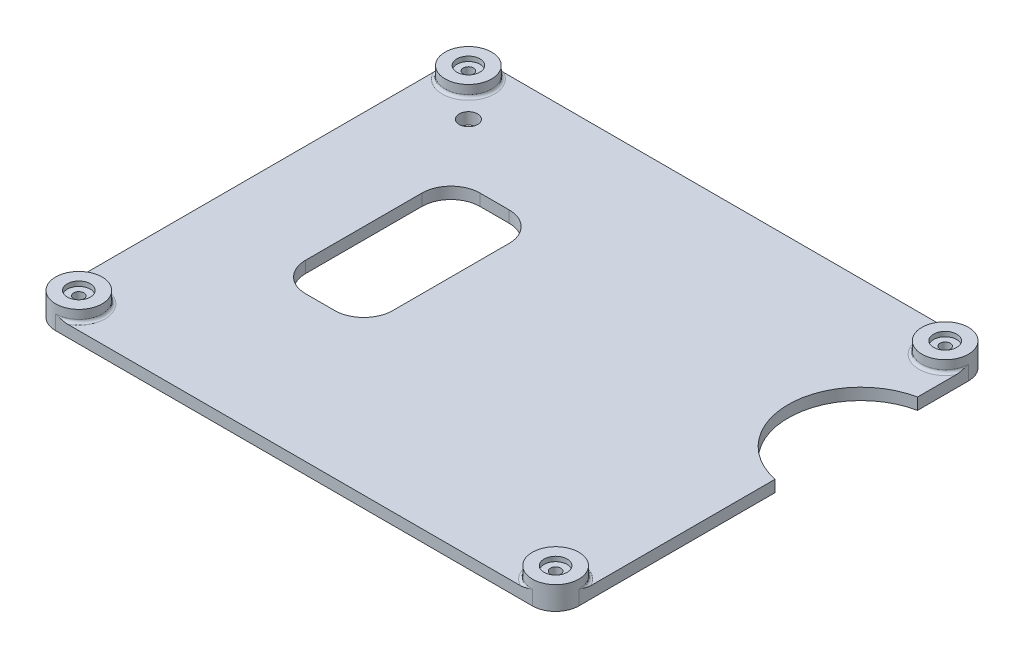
ISO-10303-21;
HEADER;
FILE_DESCRIPTION(('STEP AP214'),'2;1');
FILE_NAME('part.step','',(''),(''),'','','');
FILE_SCHEMA(('AUTOMOTIVE_DESIGN { 1 0 10303 214 1 1 1 1 }'));
ENDSEC;
DATA;
#1=APPLICATION_CONTEXT('core data for automotive mechanical design processes');
#2=APPLICATION_PROTOCOL_DEFINITION('international standard','automotive_design',2000,#1);
#3=PRODUCT_CONTEXT('',#1,'mechanical');
#4=PRODUCT('Part','Part','',(#3));
#5=PRODUCT_RELATED_PRODUCT_CATEGORY('part','',(#4));
#6=PRODUCT_DEFINITION_FORMATION('','',#4);
#7=PRODUCT_DEFINITION_CONTEXT('part definition',#1,'design');
#8=PRODUCT_DEFINITION('design','',#6,#7);
#9=PRODUCT_DEFINITION_SHAPE('','',#8);
#10=(LENGTH_UNIT() NAMED_UNIT(*) SI_UNIT(.MILLI.,.METRE.));
#11=(NAMED_UNIT(*) PLANE_ANGLE_UNIT() SI_UNIT($,.RADIAN.));
#12=(NAMED_UNIT(*) SI_UNIT($,.STERADIAN.) SOLID_ANGLE_UNIT());
#13=UNCERTAINTY_MEASURE_WITH_UNIT(LENGTH_MEASURE(1.E-05),#10,'distance_accuracy_value','');
#14=(GEOMETRIC_REPRESENTATION_CONTEXT(3) GLOBAL_UNCERTAINTY_ASSIGNED_CONTEXT((#13)) GLOBAL_UNIT_ASSIGNED_CONTEXT((#10,
#11,#12)) REPRESENTATION_CONTEXT('',''));
#15=CARTESIAN_POINT('',(0.,0.,0.));
#16=DIRECTION('',(0.,0.,1.));
#17=DIRECTION('',(1.,0.,0.));
#18=AXIS2_PLACEMENT_3D('',#15,#16,#17);
#19=CARTESIAN_POINT('',(-45.,2.,-37.5));
#20=DIRECTION('',(0.,-1.,0.));
#21=DIRECTION('',(0.,0.,-1.));
#22=AXIS2_PLACEMENT_3D('',#19,#20,#21);
#23=PLANE('',#22);
#24=CARTESIAN_POINT('',(-35.,2.,-27.5));
#25=DIRECTION('',(0.,1.,0.));
#26=DIRECTION('',(0.,0.,1.));
#27=AXIS2_PLACEMENT_3D('',#24,#25,#26);
#28=CIRCLE('',#27,1.5875);
#29=CARTESIAN_POINT('',(-35.,2.,-25.9125));
#30=VERTEX_POINT('',#29);
#31=EDGE_CURVE('E555',#30,#30,#28,.T.);
#32=ORIENTED_EDGE('',*,*,#31,.F.);
#33=EDGE_LOOP('',(#32));
#34=FACE_BOUND('',#33,.T.);
#35=DIRECTION('',(0.,0.,1.));
#36=VECTOR('',#35,1.);
#37=CARTESIAN_POINT('',(-28.,2.,-12.5));
#38=LINE('',#37,#36);
#39=CARTESIAN_POINT('',(-28.,2.,-12.5));
#40=VERTEX_POINT('',#39);
#41=CARTESIAN_POINT('',(-28.,2.,7.5));
#42=VERTEX_POINT('',#41);
#43=EDGE_CURVE('E196',#40,#42,#38,.T.);
#44=ORIENTED_EDGE('',*,*,#43,.F.);
#45=CARTESIAN_POINT('',(-23.,2.,-12.5));
#46=DIRECTION('',(0.,1.,0.));
#47=DIRECTION('',(0.,0.,1.));
#48=AXIS2_PLACEMENT_3D('',#45,#46,#47);
#49=CIRCLE('',#48,5.);
#50=CARTESIAN_POINT('',(-23.,2.,-17.5));
#51=VERTEX_POINT('',#50);
#52=EDGE_CURVE('E200',#51,#40,#49,.T.);
#53=ORIENTED_EDGE('',*,*,#52,.F.);
#54=DIRECTION('',(-1.,0.,0.));
#55=VECTOR('',#54,1.);
#56=CARTESIAN_POINT('',(-23.,2.,-17.5));
#57=LINE('',#56,#55);
#58=CARTESIAN_POINT('',(-18.,2.,-17.5));
#59=VERTEX_POINT('',#58);
#60=EDGE_CURVE('E219',#59,#51,#57,.T.);
#61=ORIENTED_EDGE('',*,*,#60,.F.);
#62=CARTESIAN_POINT('',(-18.,2.,-12.5));
#63=DIRECTION('',(0.,1.,0.));
#64=DIRECTION('',(0.,0.,-1.));
#65=AXIS2_PLACEMENT_3D('',#62,#63,#64);
#66=CIRCLE('',#65,5.);
#67=CARTESIAN_POINT('',(-13.,2.,-12.5));
#68=VERTEX_POINT('',#67);
#69=EDGE_CURVE('E216',#68,#59,#66,.T.);
#70=ORIENTED_EDGE('',*,*,#69,.F.);
#71=DIRECTION('',(0.,0.,-1.));
#72=VECTOR('',#71,1.);
#73=CARTESIAN_POINT('',(-13.,2.,-12.5));
#74=LINE('',#73,#72);
#75=CARTESIAN_POINT('',(-13.,2.,7.5));
#76=VERTEX_POINT('',#75);
#77=EDGE_CURVE('E213',#76,#68,#74,.T.);
#78=ORIENTED_EDGE('',*,*,#77,.F.);
#79=CARTESIAN_POINT('',(-18.,2.,7.5));
#80=DIRECTION('',(0.,1.,0.));
#81=DIRECTION('',(0.,0.,1.));
#82=AXIS2_PLACEMENT_3D('',#79,#80,#81);
#83=CIRCLE('',#82,5.);
#84=CARTESIAN_POINT('',(-18.,2.,12.5));
#85=VERTEX_POINT('',#84);
#86=EDGE_CURVE('E207',#85,#76,#83,.T.);
#87=ORIENTED_EDGE('',*,*,#86,.F.);
#88=DIRECTION('',(1.,0.,0.));
#89=VECTOR('',#88,1.);
#90=CARTESIAN_POINT('',(-23.,2.,12.5));
#91=LINE('',#90,#89);
#92=CARTESIAN_POINT('',(-23.,2.,12.5));
#93=VERTEX_POINT('',#92);
#94=EDGE_CURVE('E205',#93,#85,#91,.T.);
#95=ORIENTED_EDGE('',*,*,#94,.F.);
#96=CARTESIAN_POINT('',(-23.,2.,7.5));
#97=DIRECTION('',(0.,1.,0.));
#98=DIRECTION('',(0.,0.,1.));
#99=AXIS2_PLACEMENT_3D('',#96,#97,#98);
#100=CIRCLE('',#99,5.);
#101=EDGE_CURVE('E184',#42,#93,#100,.T.);
#102=ORIENTED_EDGE('',*,*,#101,.F.);
#103=EDGE_LOOP('',(#44,#53,#61,#70,#78,#87,#95,#102));
#104=FACE_BOUND('',#103,.T.);
#105=DIRECTION('',(1.,0.,0.));
#106=VECTOR('',#105,1.);
#107=CARTESIAN_POINT('',(-45.,2.,37.5));
#108=LINE('',#107,#106);
#109=CARTESIAN_POINT('',(-38.9384471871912,2.,37.5));
#110=VERTEX_POINT('',#109);
#111=CARTESIAN_POINT('',(38.9384471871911,2.,37.5));
#112=VERTEX_POINT('',#111);
#113=EDGE_CURVE('E317',#110,#112,#108,.T.);
#114=ORIENTED_EDGE('',*,*,#113,.T.);
#115=CARTESIAN_POINT('',(41.,2.,33.5));
#116=DIRECTION('',(0.,-1.,0.));
#117=DIRECTION('',(0.,0.,-1.));
#118=AXIS2_PLACEMENT_3D('',#115,#116,#117);
#119=CIRCLE('',#118,4.5);
#120=CARTESIAN_POINT('',(45.,2.,31.4384471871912));
#121=VERTEX_POINT('',#120);
#122=EDGE_CURVE('E329',#112,#121,#119,.T.);
#123=ORIENTED_EDGE('',*,*,#122,.T.);
#124=DIRECTION('',(0.,0.,-1.));
#125=VECTOR('',#124,1.);
#126=CARTESIAN_POINT('',(45.,2.,37.5));
#127=LINE('',#126,#125);
#128=CARTESIAN_POINT('',(45.,2.,-0.252551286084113));
#129=VERTEX_POINT('',#128);
#130=EDGE_CURVE('E276',#121,#129,#127,.T.);
#131=ORIENTED_EDGE('',*,*,#130,.T.);
#132=CARTESIAN_POINT('',(47.5,2.,-12.5));
#133=DIRECTION('',(0.,-1.,0.));
#134=DIRECTION('',(0.,0.,-1.));
#135=AXIS2_PLACEMENT_3D('',#132,#133,#134);
#136=CIRCLE('',#135,12.5);
#137=CARTESIAN_POINT('',(45.,2.,-24.7474487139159));
#138=VERTEX_POINT('',#137);
#139=EDGE_CURVE('E258',#138,#129,#136,.F.);
#140=ORIENTED_EDGE('',*,*,#139,.F.);
#141=CARTESIAN_POINT('',(45.,2.,-31.4384471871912));
#142=VERTEX_POINT('',#141);
#143=EDGE_CURVE('E279',#138,#142,#127,.T.);
#144=ORIENTED_EDGE('',*,*,#143,.T.);
#145=CARTESIAN_POINT('',(41.,2.,-33.5));
#146=DIRECTION('',(0.,-1.,0.));
#147=DIRECTION('',(0.,0.,-1.));
#148=AXIS2_PLACEMENT_3D('',#145,#146,#147);
#149=CIRCLE('',#148,4.5);
#150=CARTESIAN_POINT('',(38.9384471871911,2.,-37.5));
#151=VERTEX_POINT('',#150);
#152=EDGE_CURVE('E327',#142,#151,#149,.T.);
#153=ORIENTED_EDGE('',*,*,#152,.T.);
#154=DIRECTION('',(-1.,0.,0.));
#155=VECTOR('',#154,1.);
#156=CARTESIAN_POINT('',(-45.,2.,-37.5));
#157=LINE('',#156,#155);
#158=CARTESIAN_POINT('',(-38.9384471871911,2.,-37.5));
#159=VERTEX_POINT('',#158);
#160=EDGE_CURVE('E278',#151,#159,#157,.T.);
#161=ORIENTED_EDGE('',*,*,#160,.T.);
#162=CARTESIAN_POINT('',(-41.,2.,-33.5));
#163=DIRECTION('',(0.,-1.,0.));
#164=DIRECTION('',(0.,0.,-1.));
#165=AXIS2_PLACEMENT_3D('',#162,#163,#164);
#166=CIRCLE('',#165,4.5);
#167=CARTESIAN_POINT('',(-45.,2.,-31.4384471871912));
#168=VERTEX_POINT('',#167);
#169=EDGE_CURVE('E325',#159,#168,#166,.T.);
#170=ORIENTED_EDGE('',*,*,#169,.T.);
#171=DIRECTION('',(0.,0.,1.));
#172=VECTOR('',#171,1.);
#173=CARTESIAN_POINT('',(-45.,2.,37.5));
#174=LINE('',#173,#172);
#175=CARTESIAN_POINT('',(-45.,2.,31.4384471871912));
#176=VERTEX_POINT('',#175);
#177=EDGE_CURVE('E275',#168,#176,#174,.T.);
#178=ORIENTED_EDGE('',*,*,#177,.T.);
#179=CARTESIAN_POINT('',(-41.,2.,33.5));
#180=DIRECTION('',(0.,-1.,0.));
#181=DIRECTION('',(0.,0.,-1.));
#182=AXIS2_PLACEMENT_3D('',#179,#180,#181);
#183=CIRCLE('',#182,4.5);
#184=EDGE_CURVE('E323',#176,#110,#183,.T.);
#185=ORIENTED_EDGE('',*,*,#184,.T.);
#186=EDGE_LOOP('',(#114,#123,#131,#140,#144,#153,#161,#170,#178,#185));
#187=FACE_BOUND('',#186,.T.);
#188=ADVANCED_FACE('F28',(#34,#104,#187),#23,.F.);
#189=CARTESIAN_POINT('',(45.,2.,37.5));
#190=DIRECTION('',(-1.,0.,0.));
#191=DIRECTION('',(0.,0.,1.));
#192=AXIS2_PLACEMENT_3D('',#189,#190,#191);
#193=PLANE('',#192);
#194=DIRECTION('',(0.,-1.,0.));
#195=VECTOR('',#194,1.);
#196=CARTESIAN_POINT('',(45.,148.463519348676,-24.7474487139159));
#197=LINE('',#196,#195);
#198=CARTESIAN_POINT('',(45.,0.,-24.7474487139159));
#199=VERTEX_POINT('',#198);
#200=EDGE_CURVE('E245',#138,#199,#197,.T.);
#201=ORIENTED_EDGE('',*,*,#200,.T.);
#202=DIRECTION('',(0.,0.,-1.));
#203=VECTOR('',#202,1.);
#204=CARTESIAN_POINT('',(45.,0.,37.5));
#205=LINE('',#204,#203);
#206=CARTESIAN_POINT('',(45.,0.,-33.5));
#207=VERTEX_POINT('',#206);
#208=EDGE_CURVE('E268',#199,#207,#205,.T.);
#209=ORIENTED_EDGE('',*,*,#208,.T.);
#210=DIRECTION('',(0.,-1.,0.));
#211=VECTOR('',#210,1.);
#212=CARTESIAN_POINT('',(45.,2.,-33.5));
#213=LINE('',#212,#211);
#214=CARTESIAN_POINT('',(45.,2.5,-33.5));
#215=VERTEX_POINT('',#214);
#216=EDGE_CURVE('E282',#207,#215,#213,.F.);
#217=ORIENTED_EDGE('',*,*,#216,.T.);
#218=CARTESIAN_POINT('',(45.,2.,-31.4384471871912));
#219=CARTESIAN_POINT('',(45.,2.000008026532,-31.4809892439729));
#220=CARTESIAN_POINT('',(45.,2.00113841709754,-31.5235145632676));
#221=CARTESIAN_POINT('',(45.,2.00537603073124,-31.6084445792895));
#222=CARTESIAN_POINT('',(45.,2.00848213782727,-31.6508493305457));
#223=CARTESIAN_POINT('',(45.,2.02034471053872,-31.7776096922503));
#224=CARTESIAN_POINT('',(45.,2.0316481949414,-31.8617275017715));
#225=CARTESIAN_POINT('',(45.,2.05935852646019,-32.0284274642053));
#226=CARTESIAN_POINT('',(45.,2.07572639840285,-32.1110164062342));
#227=CARTESIAN_POINT('',(45.,2.11243465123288,-32.2753554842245));
#228=CARTESIAN_POINT('',(45.,2.13277785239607,-32.3571049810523));
#229=CARTESIAN_POINT('',(45.,2.20227499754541,-32.6160090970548));
#230=CARTESIAN_POINT('',(45.,2.25704389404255,-32.7916302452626));
#231=CARTESIAN_POINT('',(45.,2.37310658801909,-33.140867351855));
#232=CARTESIAN_POINT('',(45.,2.43441045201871,-33.3144797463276));
#233=CARTESIAN_POINT('',(45.,2.49718908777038,-33.492049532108));
#234=CARTESIAN_POINT('',(45.,2.49859454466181,-33.4960247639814));
#235=CARTESIAN_POINT('',(45.,2.5,-33.5));
#236=B_SPLINE_CURVE_WITH_KNOTS('',3,(#218,#219,#220,#221,#222,#223,#224,#225,#226,#227,#228,
#229,#230,#231,#232,#233,#234,#235),.UNSPECIFIED.,.F.,.F.,(4,2,2,2,2,2,2,2,4),(0.,
0.127585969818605,0.255099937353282,0.509481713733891,0.761952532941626,1.01460312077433,
1.56611411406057,2.11848728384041,2.13113639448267),.UNSPECIFIED.);
#237=EDGE_CURVE('E407',#215,#142,#236,.F.);
#238=ORIENTED_EDGE('',*,*,#237,.T.);
#239=ORIENTED_EDGE('',*,*,#143,.F.);
#240=EDGE_LOOP('',(#201,#209,#217,#238,#239));
#241=FACE_BOUND('',#240,.T.);
#242=ADVANCED_FACE('F360',(#241),#193,.F.);
#243=DIRECTION('',(0.,-1.,0.));
#244=VECTOR('',#243,1.);
#245=CARTESIAN_POINT('',(45.,148.463519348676,-0.252551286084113));
#246=LINE('',#245,#244);
#247=CARTESIAN_POINT('',(45.,0.,-0.252551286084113));
#248=VERTEX_POINT('',#247);
#249=EDGE_CURVE('E256',#129,#248,#246,.T.);
#250=ORIENTED_EDGE('',*,*,#249,.F.);
#251=ORIENTED_EDGE('',*,*,#130,.F.);
#252=CARTESIAN_POINT('',(45.,2.,31.4384471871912));
#253=CARTESIAN_POINT('',(45.,2.00000802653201,31.4809892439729));
#254=CARTESIAN_POINT('',(45.,2.00113841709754,31.5235145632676));
#255=CARTESIAN_POINT('',(45.,2.00537603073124,31.6084445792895));
#256=CARTESIAN_POINT('',(45.,2.00848213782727,31.6508493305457));
#257=CARTESIAN_POINT('',(45.,2.02034471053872,31.7776096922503));
#258=CARTESIAN_POINT('',(45.,2.0316481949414,31.8617275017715));
#259=CARTESIAN_POINT('',(45.,2.05935852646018,32.0284274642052));
#260=CARTESIAN_POINT('',(45.,2.07572639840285,32.1110164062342));
#261=CARTESIAN_POINT('',(45.,2.11243465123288,32.2753554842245));
#262=CARTESIAN_POINT('',(45.,2.13277785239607,32.3571049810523));
#263=CARTESIAN_POINT('',(45.,2.20227499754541,32.6160090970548));
#264=CARTESIAN_POINT('',(45.,2.25704389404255,32.7916302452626));
#265=CARTESIAN_POINT('',(45.,2.37310658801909,33.140867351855));
#266=CARTESIAN_POINT('',(45.,2.43441045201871,33.3144797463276));
#267=CARTESIAN_POINT('',(45.,2.49718908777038,33.492049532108));
#268=CARTESIAN_POINT('',(45.,2.49859454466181,33.4960247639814));
#269=CARTESIAN_POINT('',(45.,2.5,33.5));
#270=B_SPLINE_CURVE_WITH_KNOTS('',3,(#252,#253,#254,#255,#256,#257,#258,#259,#260,#261,#262,
#263,#264,#265,#266,#267,#268,#269),.UNSPECIFIED.,.F.,.F.,(4,2,2,2,2,2,2,2,4),(0.,
0.127585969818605,0.255099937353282,0.50948171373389,0.761952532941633,1.01460312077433,
1.56611411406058,2.11848728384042,2.13113639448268),.UNSPECIFIED.);
#271=CARTESIAN_POINT('',(45.,2.5,33.5));
#272=VERTEX_POINT('',#271);
#273=EDGE_CURVE('E345',#121,#272,#270,.T.);
#274=ORIENTED_EDGE('',*,*,#273,.T.);
#275=DIRECTION('',(0.,-1.,0.));
#276=VECTOR('',#275,1.);
#277=CARTESIAN_POINT('',(45.,2.,33.5));
#278=LINE('',#277,#276);
#279=CARTESIAN_POINT('',(45.,0.,33.5));
#280=VERTEX_POINT('',#279);
#281=EDGE_CURVE('E284',#272,#280,#278,.T.);
#282=ORIENTED_EDGE('',*,*,#281,.T.);
#283=EDGE_CURVE('E269',#280,#248,#205,.T.);
#284=ORIENTED_EDGE('',*,*,#283,.T.);
#285=EDGE_LOOP('',(#250,#251,#274,#282,#284));
#286=FACE_BOUND('',#285,.T.);
#287=ADVANCED_FACE('F427',(#286),#193,.F.);
#288=CARTESIAN_POINT('',(-45.,0.,-37.5));
#289=DIRECTION('',(0.,-1.,0.));
#290=DIRECTION('',(0.,0.,-1.));
#291=AXIS2_PLACEMENT_3D('',#288,#289,#290);
#292=PLANE('',#291);
#293=CARTESIAN_POINT('',(-35.,0.,-27.5));
#294=DIRECTION('',(0.,-1.,0.));
#295=DIRECTION('',(0.,0.,-1.));
#296=AXIS2_PLACEMENT_3D('',#293,#294,#295);
#297=CIRCLE('',#296,1.5875);
#298=CARTESIAN_POINT('',(-35.,0.,-29.0875));
#299=VERTEX_POINT('',#298);
#300=EDGE_CURVE('E33',#299,#299,#297,.T.);
#301=ORIENTED_EDGE('',*,*,#300,.F.);
#302=EDGE_LOOP('',(#301));
#303=FACE_BOUND('',#302,.T.);
#304=CARTESIAN_POINT('',(-41.,0.,-33.5));
#305=DIRECTION('',(0.,-1.,0.));
#306=DIRECTION('',(0.,0.,-1.));
#307=AXIS2_PLACEMENT_3D('',#304,#305,#306);
#308=CIRCLE('',#307,0.889000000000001);
#309=CARTESIAN_POINT('',(-41.,0.,-34.389));
#310=VERTEX_POINT('',#309);
#311=EDGE_CURVE('E545',#310,#310,#308,.T.);
#312=ORIENTED_EDGE('',*,*,#311,.F.);
#313=EDGE_LOOP('',(#312));
#314=FACE_BOUND('',#313,.T.);
#315=CARTESIAN_POINT('',(-41.,0.,33.5));
#316=DIRECTION('',(0.,-1.,0.));
#317=DIRECTION('',(0.,0.,-1.));
#318=AXIS2_PLACEMENT_3D('',#315,#316,#317);
#319=CIRCLE('',#318,0.889000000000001);
#320=CARTESIAN_POINT('',(-41.,0.,32.611));
#321=VERTEX_POINT('',#320);
#322=EDGE_CURVE('E569',#321,#321,#319,.T.);
#323=ORIENTED_EDGE('',*,*,#322,.F.);
#324=EDGE_LOOP('',(#323));
#325=FACE_BOUND('',#324,.T.);
#326=CARTESIAN_POINT('',(41.,0.,33.5));
#327=DIRECTION('',(0.,-1.,0.));
#328=DIRECTION('',(0.,0.,-1.));
#329=AXIS2_PLACEMENT_3D('',#326,#327,#328);
#330=CIRCLE('',#329,0.889000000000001);
#331=CARTESIAN_POINT('',(41.,0.,32.611));
#332=VERTEX_POINT('',#331);
#333=EDGE_CURVE('E579',#332,#332,#330,.T.);
#334=ORIENTED_EDGE('',*,*,#333,.F.);
#335=EDGE_LOOP('',(#334));
#336=FACE_BOUND('',#335,.T.);
#337=CARTESIAN_POINT('',(41.,0.,-33.5));
#338=DIRECTION('',(0.,-1.,0.));
#339=DIRECTION('',(0.,0.,-1.));
#340=AXIS2_PLACEMENT_3D('',#337,#338,#339);
#341=CIRCLE('',#340,0.889000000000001);
#342=CARTESIAN_POINT('',(41.,0.,-34.389));
#343=VERTEX_POINT('',#342);
#344=EDGE_CURVE('E589',#343,#343,#341,.T.);
#345=ORIENTED_EDGE('',*,*,#344,.F.);
#346=EDGE_LOOP('',(#345));
#347=FACE_BOUND('',#346,.T.);
#348=CARTESIAN_POINT('',(-23.,0.,-12.5));
#349=DIRECTION('',(0.,1.,0.));
#350=DIRECTION('',(0.,0.,1.));
#351=AXIS2_PLACEMENT_3D('',#348,#349,#350);
#352=CIRCLE('',#351,5.);
#353=CARTESIAN_POINT('',(-23.,0.,-17.5));
#354=VERTEX_POINT('',#353);
#355=CARTESIAN_POINT('',(-28.,0.,-12.5));
#356=VERTEX_POINT('',#355);
#357=EDGE_CURVE('E222',#354,#356,#352,.T.);
#358=ORIENTED_EDGE('',*,*,#357,.T.);
#359=DIRECTION('',(0.,0.,1.));
#360=VECTOR('',#359,1.);
#361=CARTESIAN_POINT('',(-28.,0.,-12.5));
#362=LINE('',#361,#360);
#363=CARTESIAN_POINT('',(-28.,0.,7.5));
#364=VERTEX_POINT('',#363);
#365=EDGE_CURVE('E225',#356,#364,#362,.T.);
#366=ORIENTED_EDGE('',*,*,#365,.T.);
#367=CARTESIAN_POINT('',(-23.,0.,7.5));
#368=DIRECTION('',(0.,1.,0.));
#369=DIRECTION('',(0.,0.,1.));
#370=AXIS2_PLACEMENT_3D('',#367,#368,#369);
#371=CIRCLE('',#370,5.);
#372=CARTESIAN_POINT('',(-23.,0.,12.5));
#373=VERTEX_POINT('',#372);
#374=EDGE_CURVE('E187',#364,#373,#371,.T.);
#375=ORIENTED_EDGE('',*,*,#374,.T.);
#376=DIRECTION('',(1.,0.,0.));
#377=VECTOR('',#376,1.);
#378=CARTESIAN_POINT('',(-23.,0.,12.5));
#379=LINE('',#378,#377);
#380=CARTESIAN_POINT('',(-18.,0.,12.5));
#381=VERTEX_POINT('',#380);
#382=EDGE_CURVE('E228',#373,#381,#379,.T.);
#383=ORIENTED_EDGE('',*,*,#382,.T.);
#384=CARTESIAN_POINT('',(-18.,0.,7.5));
#385=DIRECTION('',(0.,1.,0.));
#386=DIRECTION('',(0.,0.,1.));
#387=AXIS2_PLACEMENT_3D('',#384,#385,#386);
#388=CIRCLE('',#387,5.);
#389=CARTESIAN_POINT('',(-13.,0.,7.5));
#390=VERTEX_POINT('',#389);
#391=EDGE_CURVE('E231',#381,#390,#388,.T.);
#392=ORIENTED_EDGE('',*,*,#391,.T.);
#393=DIRECTION('',(0.,0.,-1.));
#394=VECTOR('',#393,1.);
#395=CARTESIAN_POINT('',(-13.,0.,-12.5));
#396=LINE('',#395,#394);
#397=CARTESIAN_POINT('',(-13.,0.,-12.5));
#398=VERTEX_POINT('',#397);
#399=EDGE_CURVE('E234',#390,#398,#396,.T.);
#400=ORIENTED_EDGE('',*,*,#399,.T.);
#401=CARTESIAN_POINT('',(-18.,0.,-12.5));
#402=DIRECTION('',(0.,1.,0.));
#403=DIRECTION('',(0.,0.,-1.));
#404=AXIS2_PLACEMENT_3D('',#401,#402,#403);
#405=CIRCLE('',#404,5.);
#406=CARTESIAN_POINT('',(-18.,0.,-17.5));
#407=VERTEX_POINT('',#406);
#408=EDGE_CURVE('E237',#398,#407,#405,.T.);
#409=ORIENTED_EDGE('',*,*,#408,.T.);
#410=DIRECTION('',(-1.,0.,0.));
#411=VECTOR('',#410,1.);
#412=CARTESIAN_POINT('',(-23.,0.,-17.5));
#413=LINE('',#412,#411);
#414=EDGE_CURVE('E240',#407,#354,#413,.T.);
#415=ORIENTED_EDGE('',*,*,#414,.T.);
#416=EDGE_LOOP('',(#358,#366,#375,#383,#392,#400,#409,#415));
#417=FACE_BOUND('',#416,.T.);
#418=ORIENTED_EDGE('',*,*,#208,.F.);
#419=CARTESIAN_POINT('',(47.5,0.,-12.5));
#420=DIRECTION('',(0.,-1.,0.));
#421=DIRECTION('',(0.,0.,-1.));
#422=AXIS2_PLACEMENT_3D('',#419,#420,#421);
#423=CIRCLE('',#422,12.5);
#424=EDGE_CURVE('E306',#199,#248,#423,.F.);
#425=ORIENTED_EDGE('',*,*,#424,.T.);
#426=ORIENTED_EDGE('',*,*,#283,.F.);
#427=CARTESIAN_POINT('',(41.,0.,33.5));
#428=DIRECTION('',(0.,-1.,0.));
#429=DIRECTION('',(0.,0.,-1.));
#430=AXIS2_PLACEMENT_3D('',#427,#428,#429);
#431=CIRCLE('',#430,4.);
#432=CARTESIAN_POINT('',(41.,0.,37.5));
#433=VERTEX_POINT('',#432);
#434=EDGE_CURVE('E294',#280,#433,#431,.T.);
#435=ORIENTED_EDGE('',*,*,#434,.T.);
#436=DIRECTION('',(1.,0.,0.));
#437=VECTOR('',#436,1.);
#438=CARTESIAN_POINT('',(-45.,0.,37.5));
#439=LINE('',#438,#437);
#440=CARTESIAN_POINT('',(-41.,0.,37.5));
#441=VERTEX_POINT('',#440);
#442=EDGE_CURVE('E265',#441,#433,#439,.T.);
#443=ORIENTED_EDGE('',*,*,#442,.F.);
#444=CARTESIAN_POINT('',(-41.,0.,33.5));
#445=DIRECTION('',(0.,-1.,0.));
#446=DIRECTION('',(0.,0.,-1.));
#447=AXIS2_PLACEMENT_3D('',#444,#445,#446);
#448=CIRCLE('',#447,4.);
#449=CARTESIAN_POINT('',(-45.,0.,33.5));
#450=VERTEX_POINT('',#449);
#451=EDGE_CURVE('E287',#441,#450,#448,.T.);
#452=ORIENTED_EDGE('',*,*,#451,.T.);
#453=DIRECTION('',(0.,0.,1.));
#454=VECTOR('',#453,1.);
#455=CARTESIAN_POINT('',(-45.,0.,37.5));
#456=LINE('',#455,#454);
#457=CARTESIAN_POINT('',(-45.,0.,-33.5));
#458=VERTEX_POINT('',#457);
#459=EDGE_CURVE('E263',#458,#450,#456,.T.);
#460=ORIENTED_EDGE('',*,*,#459,.F.);
#461=CARTESIAN_POINT('',(-41.,0.,-33.5));
#462=DIRECTION('',(0.,-1.,0.));
#463=DIRECTION('',(0.,0.,-1.));
#464=AXIS2_PLACEMENT_3D('',#461,#462,#463);
#465=CIRCLE('',#464,4.);
#466=CARTESIAN_POINT('',(-41.,0.,-37.5));
#467=VERTEX_POINT('',#466);
#468=EDGE_CURVE('E289',#458,#467,#465,.T.);
#469=ORIENTED_EDGE('',*,*,#468,.T.);
#470=DIRECTION('',(-1.,0.,0.));
#471=VECTOR('',#470,1.);
#472=CARTESIAN_POINT('',(-45.,0.,-37.5));
#473=LINE('',#472,#471);
#474=CARTESIAN_POINT('',(41.,0.,-37.5));
#475=VERTEX_POINT('',#474);
#476=EDGE_CURVE('E272',#475,#467,#473,.T.);
#477=ORIENTED_EDGE('',*,*,#476,.F.);
#478=CARTESIAN_POINT('',(41.,0.,-33.5));
#479=DIRECTION('',(0.,-1.,0.));
#480=DIRECTION('',(0.,0.,-1.));
#481=AXIS2_PLACEMENT_3D('',#478,#479,#480);
#482=CIRCLE('',#481,4.);
#483=EDGE_CURVE('E291',#475,#207,#482,.T.);
#484=ORIENTED_EDGE('',*,*,#483,.T.);
#485=EDGE_LOOP('',(#418,#425,#426,#435,#443,#452,#460,#469,#477,#484));
#486=FACE_BOUND('',#485,.T.);
#487=ADVANCED_FACE('F424',(#303,#314,#325,#336,#347,#417,#486),#292,.T.);
#488=CARTESIAN_POINT('',(-45.,2.,37.5));
#489=DIRECTION('',(1.,0.,0.));
#490=DIRECTION('',(0.,0.,-1.));
#491=AXIS2_PLACEMENT_3D('',#488,#489,#490);
#492=PLANE('',#491);
#493=ORIENTED_EDGE('',*,*,#177,.F.);
#494=CARTESIAN_POINT('',(-45.,2.,-31.4384471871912));
#495=CARTESIAN_POINT('',(-45.,2.000008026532,-31.4809892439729));
#496=CARTESIAN_POINT('',(-45.,2.00113841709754,-31.5235145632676));
#497=CARTESIAN_POINT('',(-45.,2.00537603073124,-31.6084445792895));
#498=CARTESIAN_POINT('',(-45.,2.00848213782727,-31.6508493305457));
#499=CARTESIAN_POINT('',(-45.,2.02034471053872,-31.7776096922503));
#500=CARTESIAN_POINT('',(-45.,2.0316481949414,-31.8617275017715));
#501=CARTESIAN_POINT('',(-45.,2.05935852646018,-32.0284274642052));
#502=CARTESIAN_POINT('',(-45.,2.07572639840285,-32.1110164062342));
#503=CARTESIAN_POINT('',(-45.,2.11243465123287,-32.2753554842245));
#504=CARTESIAN_POINT('',(-45.,2.13277785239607,-32.3571049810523));
#505=CARTESIAN_POINT('',(-45.,2.20227499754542,-32.6160090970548));
#506=CARTESIAN_POINT('',(-45.,2.25704389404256,-32.7916302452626));
#507=CARTESIAN_POINT('',(-45.,2.37310658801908,-33.140867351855));
#508=CARTESIAN_POINT('',(-45.,2.43441045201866,-33.3144797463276));
#509=CARTESIAN_POINT('',(-45.,2.49718908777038,-33.4920495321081));
#510=CARTESIAN_POINT('',(-45.,2.49859454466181,-33.4960247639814));
#511=CARTESIAN_POINT('',(-45.,2.5,-33.5));
#512=B_SPLINE_CURVE_WITH_KNOTS('',3,(#494,#495,#496,#497,#498,#499,#500,#501,#502,#503,#504,
#505,#506,#507,#508,#509,#510,#511),.UNSPECIFIED.,.F.,.F.,(4,2,2,2,2,2,2,2,4),(0.,
0.127585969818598,0.255099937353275,0.509481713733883,0.761952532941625,1.01460312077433,
1.56611411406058,2.11848728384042,2.13113639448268),.UNSPECIFIED.);
#513=CARTESIAN_POINT('',(-45.,2.5,-33.5));
#514=VERTEX_POINT('',#513);
#515=EDGE_CURVE('E394',#168,#514,#512,.T.);
#516=ORIENTED_EDGE('',*,*,#515,.T.);
#517=DIRECTION('',(0.,-1.,0.));
#518=VECTOR('',#517,1.);
#519=CARTESIAN_POINT('',(-45.,2.,-33.5));
#520=LINE('',#519,#518);
#521=EDGE_CURVE('E303',#514,#458,#520,.T.);
#522=ORIENTED_EDGE('',*,*,#521,.T.);
#523=ORIENTED_EDGE('',*,*,#459,.T.);
#524=DIRECTION('',(0.,-1.,0.));
#525=VECTOR('',#524,1.);
#526=CARTESIAN_POINT('',(-45.,2.,33.5));
#527=LINE('',#526,#525);
#528=CARTESIAN_POINT('',(-45.,2.5,33.5));
#529=VERTEX_POINT('',#528);
#530=EDGE_CURVE('E45',#450,#529,#527,.F.);
#531=ORIENTED_EDGE('',*,*,#530,.T.);
#532=CARTESIAN_POINT('',(-45.,2.,31.4384471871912));
#533=CARTESIAN_POINT('',(-45.,2.00000802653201,31.4809892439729));
#534=CARTESIAN_POINT('',(-45.,2.00113841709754,31.5235145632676));
#535=CARTESIAN_POINT('',(-45.,2.00537603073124,31.6084445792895));
#536=CARTESIAN_POINT('',(-45.,2.00848213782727,31.6508493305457));
#537=CARTESIAN_POINT('',(-45.,2.02034471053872,31.7776096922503));
#538=CARTESIAN_POINT('',(-45.,2.0316481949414,31.8617275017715));
#539=CARTESIAN_POINT('',(-45.,2.05935852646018,32.0284274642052));
#540=CARTESIAN_POINT('',(-45.,2.07572639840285,32.1110164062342));
#541=CARTESIAN_POINT('',(-45.,2.11243465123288,32.2753554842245));
#542=CARTESIAN_POINT('',(-45.,2.13277785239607,32.3571049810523));
#543=CARTESIAN_POINT('',(-45.,2.20227499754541,32.6160090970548));
#544=CARTESIAN_POINT('',(-45.,2.25704389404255,32.7916302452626));
#545=CARTESIAN_POINT('',(-45.,2.37310658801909,33.140867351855));
#546=CARTESIAN_POINT('',(-45.,2.43441045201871,33.3144797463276));
#547=CARTESIAN_POINT('',(-45.,2.49718908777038,33.492049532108));
#548=CARTESIAN_POINT('',(-45.,2.49859454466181,33.4960247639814));
#549=CARTESIAN_POINT('',(-45.,2.5,33.5));
#550=B_SPLINE_CURVE_WITH_KNOTS('',3,(#532,#533,#534,#535,#536,#537,#538,#539,#540,#541,#542,
#543,#544,#545,#546,#547,#548,#549),.UNSPECIFIED.,.F.,.F.,(4,2,2,2,2,2,2,2,4),(0.,
0.127585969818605,0.255099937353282,0.50948171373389,0.761952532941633,1.01460312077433,
1.56611411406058,2.11848728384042,2.13113639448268),.UNSPECIFIED.);
#551=EDGE_CURVE('E38',#529,#176,#550,.F.);
#552=ORIENTED_EDGE('',*,*,#551,.T.);
#553=EDGE_LOOP('',(#493,#516,#522,#523,#531,#552));
#554=FACE_BOUND('',#553,.T.);
#555=ADVANCED_FACE('F30',(#554),#492,.F.);
#556=CARTESIAN_POINT('',(-45.,2.,37.5));
#557=DIRECTION('',(0.,0.,-1.));
#558=DIRECTION('',(-1.,0.,0.));
#559=AXIS2_PLACEMENT_3D('',#556,#557,#558);
#560=PLANE('',#559);
#561=ORIENTED_EDGE('',*,*,#442,.T.);
#562=DIRECTION('',(0.,-1.,0.));
#563=VECTOR('',#562,1.);
#564=CARTESIAN_POINT('',(41.,2.,37.5));
#565=LINE('',#564,#563);
#566=CARTESIAN_POINT('',(41.,2.5,37.5));
#567=VERTEX_POINT('',#566);
#568=EDGE_CURVE('E296',#433,#567,#565,.F.);
#569=ORIENTED_EDGE('',*,*,#568,.T.);
#570=CARTESIAN_POINT('',(38.9384471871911,2.,37.5));
#571=CARTESIAN_POINT('',(38.980989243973,2.00000802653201,37.5));
#572=CARTESIAN_POINT('',(39.0235145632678,2.00113841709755,37.5));
#573=CARTESIAN_POINT('',(39.1084445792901,2.00537603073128,37.5));
#574=CARTESIAN_POINT('',(39.1508493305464,2.00848213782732,37.5));
#575=CARTESIAN_POINT('',(39.2776096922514,2.02034471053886,37.5));
#576=CARTESIAN_POINT('',(39.3617275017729,2.03164819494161,37.5));
#577=CARTESIAN_POINT('',(39.5284274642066,2.05935852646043,37.5));
#578=CARTESIAN_POINT('',(39.6110164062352,2.07572639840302,37.5));
#579=CARTESIAN_POINT('',(39.7753554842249,2.11243465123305,37.5));
#580=CARTESIAN_POINT('',(39.8571049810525,2.13277785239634,37.5));
#581=CARTESIAN_POINT('',(40.1160090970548,2.20227499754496,37.5));
#582=CARTESIAN_POINT('',(40.2916302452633,2.25704389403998,37.5));
#583=CARTESIAN_POINT('',(40.6408673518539,2.37310658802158,37.5));
#584=CARTESIAN_POINT('',(40.8144797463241,2.4344104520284,37.5));
#585=CARTESIAN_POINT('',(40.9920495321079,2.49718908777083,37.5));
#586=CARTESIAN_POINT('',(40.9960247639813,2.49859454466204,37.5));
#587=CARTESIAN_POINT('',(41.,2.5,37.5));
#588=B_SPLINE_CURVE_WITH_KNOTS('',3,(#570,#571,#572,#573,#574,#575,#576,#577,#578,#579,#580,
#581,#582,#583,#584,#585,#586,#587),.UNSPECIFIED.,.F.,.F.,(4,2,2,2,2,2,2,2,4),(0.,
0.127585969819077,0.255099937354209,0.50948171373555,0.761952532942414,1.01460312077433,
1.56611411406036,2.11848728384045,2.1311363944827),.UNSPECIFIED.);
#589=EDGE_CURVE('E339',#567,#112,#588,.F.);
#590=ORIENTED_EDGE('',*,*,#589,.T.);
#591=ORIENTED_EDGE('',*,*,#113,.F.);
#592=CARTESIAN_POINT('',(-38.9384471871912,2.,37.5));
#593=CARTESIAN_POINT('',(-38.980989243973,2.00000802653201,37.5));
#594=CARTESIAN_POINT('',(-39.0235145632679,2.00113841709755,37.5));
#595=CARTESIAN_POINT('',(-39.1084445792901,2.00537603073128,37.5));
#596=CARTESIAN_POINT('',(-39.1508493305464,2.00848213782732,37.5));
#597=CARTESIAN_POINT('',(-39.2776096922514,2.02034471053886,37.5));
#598=CARTESIAN_POINT('',(-39.3617275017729,2.03164819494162,37.5));
#599=CARTESIAN_POINT('',(-39.5284274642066,2.05935852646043,37.5));
#600=CARTESIAN_POINT('',(-39.6110164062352,2.07572639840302,37.5));
#601=CARTESIAN_POINT('',(-39.7753554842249,2.11243465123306,37.5));
#602=CARTESIAN_POINT('',(-39.8571049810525,2.13277785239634,37.5));
#603=CARTESIAN_POINT('',(-40.1160090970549,2.20227499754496,37.5));
#604=CARTESIAN_POINT('',(-40.2916302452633,2.25704389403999,37.5));
#605=CARTESIAN_POINT('',(-40.6408673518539,2.37310658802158,37.5));
#606=CARTESIAN_POINT('',(-40.8144797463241,2.43441045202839,37.5));
#607=CARTESIAN_POINT('',(-40.9920495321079,2.49718908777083,37.5));
#608=CARTESIAN_POINT('',(-40.9960247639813,2.49859454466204,37.5));
#609=CARTESIAN_POINT('',(-41.,2.5,37.5));
#610=B_SPLINE_CURVE_WITH_KNOTS('',3,(#592,#593,#594,#595,#596,#597,#598,#599,#600,#601,#602,
#603,#604,#605,#606,#607,#608,#609),.UNSPECIFIED.,.F.,.F.,(4,2,2,2,2,2,2,2,4),(0.,
0.127585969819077,0.255099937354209,0.50948171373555,0.761952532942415,1.01460312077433,
1.56611411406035,2.11848728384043,2.13113639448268),.UNSPECIFIED.);
#611=CARTESIAN_POINT('',(-41.,2.5,37.5));
#612=VERTEX_POINT('',#611);
#613=EDGE_CURVE('E11',#110,#612,#610,.T.);
#614=ORIENTED_EDGE('',*,*,#613,.T.);
#615=DIRECTION('',(0.,-1.,0.));
#616=VECTOR('',#615,1.);
#617=CARTESIAN_POINT('',(-41.,2.,37.5));
#618=LINE('',#617,#616);
#619=EDGE_CURVE('E53',#612,#441,#618,.T.);
#620=ORIENTED_EDGE('',*,*,#619,.T.);
#621=EDGE_LOOP('',(#561,#569,#590,#591,#614,#620));
#622=FACE_BOUND('',#621,.T.);
#623=ADVANCED_FACE('F355',(#622),#560,.F.);
#624=CARTESIAN_POINT('',(-45.,2.,-37.5));
#625=DIRECTION('',(0.,0.,1.));
#626=DIRECTION('',(1.,0.,0.));
#627=AXIS2_PLACEMENT_3D('',#624,#625,#626);
#628=PLANE('',#627);
#629=ORIENTED_EDGE('',*,*,#160,.F.);
#630=CARTESIAN_POINT('',(38.9384471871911,2.,-37.5));
#631=CARTESIAN_POINT('',(38.980989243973,2.00000802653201,-37.5));
#632=CARTESIAN_POINT('',(39.0235145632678,2.00113841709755,-37.5));
#633=CARTESIAN_POINT('',(39.1084445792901,2.00537603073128,-37.5));
#634=CARTESIAN_POINT('',(39.1508493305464,2.00848213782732,-37.5));
#635=CARTESIAN_POINT('',(39.2776096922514,2.02034471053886,-37.5));
#636=CARTESIAN_POINT('',(39.3617275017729,2.03164819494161,-37.5));
#637=CARTESIAN_POINT('',(39.5284274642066,2.05935852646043,-37.5));
#638=CARTESIAN_POINT('',(39.6110164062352,2.07572639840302,-37.5));
#639=CARTESIAN_POINT('',(39.7753554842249,2.11243465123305,-37.5));
#640=CARTESIAN_POINT('',(39.8571049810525,2.13277785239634,-37.5));
#641=CARTESIAN_POINT('',(40.1160090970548,2.20227499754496,-37.5));
#642=CARTESIAN_POINT('',(40.2916302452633,2.25704389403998,-37.5));
#643=CARTESIAN_POINT('',(40.6408673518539,2.37310658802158,-37.5));
#644=CARTESIAN_POINT('',(40.8144797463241,2.4344104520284,-37.5));
#645=CARTESIAN_POINT('',(40.9920495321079,2.49718908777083,-37.5));
#646=CARTESIAN_POINT('',(40.9960247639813,2.49859454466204,-37.5));
#647=CARTESIAN_POINT('',(41.,2.5,-37.5));
#648=B_SPLINE_CURVE_WITH_KNOTS('',3,(#630,#631,#632,#633,#634,#635,#636,#637,#638,#639,#640,
#641,#642,#643,#644,#645,#646,#647),.UNSPECIFIED.,.F.,.F.,(4,2,2,2,2,2,2,2,4),(0.,
0.127585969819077,0.255099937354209,0.50948171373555,0.761952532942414,1.01460312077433,
1.56611411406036,2.11848728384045,2.1311363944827),.UNSPECIFIED.);
#649=CARTESIAN_POINT('',(41.,2.5,-37.5));
#650=VERTEX_POINT('',#649);
#651=EDGE_CURVE('E402',#151,#650,#648,.T.);
#652=ORIENTED_EDGE('',*,*,#651,.T.);
#653=DIRECTION('',(0.,-1.,0.));
#654=VECTOR('',#653,1.);
#655=CARTESIAN_POINT('',(41.,2.,-37.5));
#656=LINE('',#655,#654);
#657=EDGE_CURVE('E300',#650,#475,#656,.T.);
#658=ORIENTED_EDGE('',*,*,#657,.T.);
#659=ORIENTED_EDGE('',*,*,#476,.T.);
#660=DIRECTION('',(0.,-1.,0.));
#661=VECTOR('',#660,1.);
#662=CARTESIAN_POINT('',(-41.,2.,-37.5));
#663=LINE('',#662,#661);
#664=CARTESIAN_POINT('',(-41.,2.5,-37.5));
#665=VERTEX_POINT('',#664);
#666=EDGE_CURVE('E298',#467,#665,#663,.F.);
#667=ORIENTED_EDGE('',*,*,#666,.T.);
#668=CARTESIAN_POINT('',(-38.9384471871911,2.,-37.5));
#669=CARTESIAN_POINT('',(-38.9809892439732,2.00000802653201,-37.5));
#670=CARTESIAN_POINT('',(-39.0235145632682,2.00113841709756,-37.5));
#671=CARTESIAN_POINT('',(-39.1084445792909,2.00537603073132,-37.5));
#672=CARTESIAN_POINT('',(-39.1508493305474,2.0084821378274,-37.5));
#673=CARTESIAN_POINT('',(-39.2776096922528,2.02034471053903,-37.5));
#674=CARTESIAN_POINT('',(-39.3617275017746,2.03164819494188,-37.5));
#675=CARTESIAN_POINT('',(-39.5284274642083,2.05935852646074,-37.5));
#676=CARTESIAN_POINT('',(-39.6110164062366,2.07572639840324,-37.5));
#677=CARTESIAN_POINT('',(-39.7753554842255,2.11243465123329,-37.5));
#678=CARTESIAN_POINT('',(-39.8571049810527,2.13277785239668,-37.5));
#679=CARTESIAN_POINT('',(-40.1160090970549,2.20227499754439,-37.5));
#680=CARTESIAN_POINT('',(-40.2916302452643,2.25704389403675,-37.5));
#681=CARTESIAN_POINT('',(-40.6408673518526,2.37310658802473,-37.5));
#682=CARTESIAN_POINT('',(-40.8144797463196,2.43441045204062,-37.4999999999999));
#683=CARTESIAN_POINT('',(-40.9920495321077,2.49718908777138,-37.5));
#684=CARTESIAN_POINT('',(-40.9960247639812,2.49859454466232,-37.5));
#685=CARTESIAN_POINT('',(-41.,2.5,-37.5));
#686=B_SPLINE_CURVE_WITH_KNOTS('',3,(#668,#669,#670,#671,#672,#673,#674,#675,#676,#677,#678,
#679,#680,#681,#682,#683,#684,#685),.UNSPECIFIED.,.F.,.F.,(4,2,2,2,2,2,2,2,4),(0.,
0.127585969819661,0.255099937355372,0.509481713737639,0.761952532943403,1.01460312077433,
1.56611411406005,2.11848728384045,2.13113639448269),.UNSPECIFIED.);
#687=EDGE_CURVE('E389',#665,#159,#686,.F.);
#688=ORIENTED_EDGE('',*,*,#687,.T.);
#689=EDGE_LOOP('',(#629,#652,#658,#659,#667,#688));
#690=FACE_BOUND('',#689,.T.);
#691=ADVANCED_FACE('F358',(#690),#628,.F.);
#692=CARTESIAN_POINT('',(41.,2.,33.5));
#693=DIRECTION('',(0.,-1.,0.));
#694=DIRECTION('',(0.,0.,-1.));
#695=AXIS2_PLACEMENT_3D('',#692,#693,#694);
#696=CYLINDRICAL_SURFACE('',#695,4.);
#697=CARTESIAN_POINT('',(41.,2.5,33.5));
#698=DIRECTION('',(0.,-1.,0.));
#699=DIRECTION('',(0.,0.,-1.));
#700=AXIS2_PLACEMENT_3D('',#697,#698,#699);
#701=CIRCLE('',#700,4.);
#702=EDGE_CURVE('E309',#272,#567,#701,.F.);
#703=ORIENTED_EDGE('',*,*,#702,.T.);
#704=ORIENTED_EDGE('',*,*,#568,.F.);
#705=ORIENTED_EDGE('',*,*,#434,.F.);
#706=ORIENTED_EDGE('',*,*,#281,.F.);
#707=EDGE_LOOP('',(#703,#704,#705,#706));
#708=FACE_BOUND('',#707,.T.);
#709=CARTESIAN_POINT('',(41.,4.,33.5));
#710=DIRECTION('',(0.,1.,0.));
#711=DIRECTION('',(0.,0.,1.));
#712=AXIS2_PLACEMENT_3D('',#709,#710,#711);
#713=CIRCLE('',#712,4.00000000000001);
#714=CARTESIAN_POINT('',(41.,4.,37.5));
#715=VERTEX_POINT('',#714);
#716=EDGE_CURVE('E590',#715,#715,#713,.T.);
#717=ORIENTED_EDGE('',*,*,#716,.F.);
#718=EDGE_LOOP('',(#717));
#719=FACE_BOUND('',#718,.T.);
#720=ADVANCED_FACE('F419',(#708,#719),#696,.T.);
#721=CARTESIAN_POINT('',(41.,2.,-33.5));
#722=DIRECTION('',(0.,-1.,0.));
#723=DIRECTION('',(0.,0.,-1.));
#724=AXIS2_PLACEMENT_3D('',#721,#722,#723);
#725=CYLINDRICAL_SURFACE('',#724,4.);
#726=CARTESIAN_POINT('',(41.,2.5,-33.5));
#727=DIRECTION('',(0.,-1.,0.));
#728=DIRECTION('',(0.,0.,-1.));
#729=AXIS2_PLACEMENT_3D('',#726,#727,#728);
#730=CIRCLE('',#729,4.);
#731=EDGE_CURVE('E331',#650,#215,#730,.F.);
#732=ORIENTED_EDGE('',*,*,#731,.T.);
#733=ORIENTED_EDGE('',*,*,#216,.F.);
#734=ORIENTED_EDGE('',*,*,#483,.F.);
#735=ORIENTED_EDGE('',*,*,#657,.F.);
#736=EDGE_LOOP('',(#732,#733,#734,#735));
#737=FACE_BOUND('',#736,.T.);
#738=CARTESIAN_POINT('',(41.,4.,-33.5));
#739=DIRECTION('',(0.,1.,0.));
#740=DIRECTION('',(0.,0.,1.));
#741=AXIS2_PLACEMENT_3D('',#738,#739,#740);
#742=CIRCLE('',#741,4.00000000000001);
#743=CARTESIAN_POINT('',(41.,4.,-29.5));
#744=VERTEX_POINT('',#743);
#745=EDGE_CURVE('E593',#744,#744,#742,.T.);
#746=ORIENTED_EDGE('',*,*,#745,.F.);
#747=EDGE_LOOP('',(#746));
#748=FACE_BOUND('',#747,.T.);
#749=ADVANCED_FACE('F431',(#737,#748),#725,.T.);
#750=CARTESIAN_POINT('',(-41.,2.,-33.5));
#751=DIRECTION('',(0.,-1.,0.));
#752=DIRECTION('',(0.,0.,-1.));
#753=AXIS2_PLACEMENT_3D('',#750,#751,#752);
#754=CYLINDRICAL_SURFACE('',#753,4.);
#755=CARTESIAN_POINT('',(-41.,2.5,-33.5));
#756=DIRECTION('',(0.,-1.,0.));
#757=DIRECTION('',(0.,0.,-1.));
#758=AXIS2_PLACEMENT_3D('',#755,#756,#757);
#759=CIRCLE('',#758,4.);
#760=EDGE_CURVE('E334',#514,#665,#759,.F.);
#761=ORIENTED_EDGE('',*,*,#760,.T.);
#762=ORIENTED_EDGE('',*,*,#666,.F.);
#763=ORIENTED_EDGE('',*,*,#468,.F.);
#764=ORIENTED_EDGE('',*,*,#521,.F.);
#765=EDGE_LOOP('',(#761,#762,#763,#764));
#766=FACE_BOUND('',#765,.T.);
#767=CARTESIAN_POINT('',(-41.,4.,-33.5));
#768=DIRECTION('',(0.,1.,0.));
#769=DIRECTION('',(0.,0.,1.));
#770=AXIS2_PLACEMENT_3D('',#767,#768,#769);
#771=CIRCLE('',#770,4.);
#772=CARTESIAN_POINT('',(-41.,4.,-29.5));
#773=VERTEX_POINT('',#772);
#774=EDGE_CURVE('E596',#773,#773,#771,.T.);
#775=ORIENTED_EDGE('',*,*,#774,.F.);
#776=EDGE_LOOP('',(#775));
#777=FACE_BOUND('',#776,.T.);
#778=ADVANCED_FACE('F435',(#766,#777),#754,.T.);
#779=CARTESIAN_POINT('',(-41.,2.,33.5));
#780=DIRECTION('',(0.,-1.,0.));
#781=DIRECTION('',(0.,0.,-1.));
#782=AXIS2_PLACEMENT_3D('',#779,#780,#781);
#783=CYLINDRICAL_SURFACE('',#782,4.);
#784=CARTESIAN_POINT('',(-41.,2.5,33.5));
#785=DIRECTION('',(0.,-1.,0.));
#786=DIRECTION('',(0.,0.,-1.));
#787=AXIS2_PLACEMENT_3D('',#784,#785,#786);
#788=CIRCLE('',#787,4.);
#789=EDGE_CURVE('E337',#612,#529,#788,.F.);
#790=ORIENTED_EDGE('',*,*,#789,.T.);
#791=ORIENTED_EDGE('',*,*,#530,.F.);
#792=ORIENTED_EDGE('',*,*,#451,.F.);
#793=ORIENTED_EDGE('',*,*,#619,.F.);
#794=EDGE_LOOP('',(#790,#791,#792,#793));
#795=FACE_BOUND('',#794,.T.);
#796=CARTESIAN_POINT('',(-41.,4.,33.5));
#797=DIRECTION('',(0.,1.,0.));
#798=DIRECTION('',(0.,0.,1.));
#799=AXIS2_PLACEMENT_3D('',#796,#797,#798);
#800=CIRCLE('',#799,4.00000000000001);
#801=CARTESIAN_POINT('',(-41.,4.,37.5));
#802=VERTEX_POINT('',#801);
#803=EDGE_CURVE('E599',#802,#802,#800,.T.);
#804=ORIENTED_EDGE('',*,*,#803,.F.);
#805=EDGE_LOOP('',(#804));
#806=FACE_BOUND('',#805,.T.);
#807=ADVANCED_FACE('F439',(#795,#806),#783,.T.);
#808=CARTESIAN_POINT('',(47.5,148.463519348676,-12.5));
#809=DIRECTION('',(0.,-1.,0.));
#810=DIRECTION('',(0.,0.,-1.));
#811=AXIS2_PLACEMENT_3D('',#808,#809,#810);
#812=CYLINDRICAL_SURFACE('',#811,12.5);
#813=ORIENTED_EDGE('',*,*,#200,.F.);
#814=ORIENTED_EDGE('',*,*,#139,.T.);
#815=ORIENTED_EDGE('',*,*,#249,.T.);
#816=ORIENTED_EDGE('',*,*,#424,.F.);
#817=EDGE_LOOP('',(#813,#814,#815,#816));
#818=FACE_BOUND('',#817,.T.);
#819=ADVANCED_FACE('F443',(#818),#812,.F.);
#820=CARTESIAN_POINT('',(-23.,0.,-12.5));
#821=DIRECTION('',(0.,1.,0.));
#822=DIRECTION('',(0.,0.,1.));
#823=AXIS2_PLACEMENT_3D('',#820,#821,#822);
#824=CYLINDRICAL_SURFACE('',#823,5.);
#825=ORIENTED_EDGE('',*,*,#52,.T.);
#826=DIRECTION('',(0.,1.,0.));
#827=VECTOR('',#826,1.);
#828=CARTESIAN_POINT('',(-28.,0.,-12.5));
#829=LINE('',#828,#827);
#830=EDGE_CURVE('E192',#356,#40,#829,.T.);
#831=ORIENTED_EDGE('',*,*,#830,.F.);
#832=ORIENTED_EDGE('',*,*,#357,.F.);
#833=DIRECTION('',(0.,1.,0.));
#834=VECTOR('',#833,1.);
#835=CARTESIAN_POINT('',(-23.,0.,-17.5));
#836=LINE('',#835,#834);
#837=EDGE_CURVE('E243',#354,#51,#836,.T.);
#838=ORIENTED_EDGE('',*,*,#837,.T.);
#839=EDGE_LOOP('',(#825,#831,#832,#838));
#840=FACE_BOUND('',#839,.T.);
#841=ADVANCED_FACE('F446',(#840),#824,.F.);
#842=CARTESIAN_POINT('',(-23.,0.,-17.5));
#843=DIRECTION('',(0.,0.,-1.));
#844=DIRECTION('',(-1.,0.,0.));
#845=AXIS2_PLACEMENT_3D('',#842,#843,#844);
#846=PLANE('',#845);
#847=ORIENTED_EDGE('',*,*,#60,.T.);
#848=ORIENTED_EDGE('',*,*,#837,.F.);
#849=ORIENTED_EDGE('',*,*,#414,.F.);
#850=DIRECTION('',(0.,1.,0.));
#851=VECTOR('',#850,1.);
#852=CARTESIAN_POINT('',(-18.,0.,-17.5));
#853=LINE('',#852,#851);
#854=EDGE_CURVE('E246',#407,#59,#853,.T.);
#855=ORIENTED_EDGE('',*,*,#854,.T.);
#856=EDGE_LOOP('',(#847,#848,#849,#855));
#857=FACE_BOUND('',#856,.T.);
#858=ADVANCED_FACE('F450',(#857),#846,.F.);
#859=CARTESIAN_POINT('',(-18.,0.,-12.5));
#860=DIRECTION('',(0.,1.,0.));
#861=DIRECTION('',(0.,0.,1.));
#862=AXIS2_PLACEMENT_3D('',#859,#860,#861);
#863=CYLINDRICAL_SURFACE('',#862,5.);
#864=ORIENTED_EDGE('',*,*,#69,.T.);
#865=ORIENTED_EDGE('',*,*,#854,.F.);
#866=ORIENTED_EDGE('',*,*,#408,.F.);
#867=DIRECTION('',(0.,1.,0.));
#868=VECTOR('',#867,1.);
#869=CARTESIAN_POINT('',(-13.,0.,-12.5));
#870=LINE('',#869,#868);
#871=EDGE_CURVE('E248',#398,#68,#870,.T.);
#872=ORIENTED_EDGE('',*,*,#871,.T.);
#873=EDGE_LOOP('',(#864,#865,#866,#872));
#874=FACE_BOUND('',#873,.T.);
#875=ADVANCED_FACE('F468',(#874),#863,.F.);
#876=CARTESIAN_POINT('',(-13.,0.,-12.5));
#877=DIRECTION('',(1.,0.,0.));
#878=DIRECTION('',(0.,0.,-1.));
#879=AXIS2_PLACEMENT_3D('',#876,#877,#878);
#880=PLANE('',#879);
#881=ORIENTED_EDGE('',*,*,#77,.T.);
#882=ORIENTED_EDGE('',*,*,#871,.F.);
#883=ORIENTED_EDGE('',*,*,#399,.F.);
#884=DIRECTION('',(0.,1.,0.));
#885=VECTOR('',#884,1.);
#886=CARTESIAN_POINT('',(-13.,0.,7.5));
#887=LINE('',#886,#885);
#888=EDGE_CURVE('E250',#390,#76,#887,.T.);
#889=ORIENTED_EDGE('',*,*,#888,.T.);
#890=EDGE_LOOP('',(#881,#882,#883,#889));
#891=FACE_BOUND('',#890,.T.);
#892=ADVANCED_FACE('F464',(#891),#880,.F.);
#893=CARTESIAN_POINT('',(-18.,0.,7.5));
#894=DIRECTION('',(0.,1.,0.));
#895=DIRECTION('',(0.,0.,1.));
#896=AXIS2_PLACEMENT_3D('',#893,#894,#895);
#897=CYLINDRICAL_SURFACE('',#896,5.);
#898=ORIENTED_EDGE('',*,*,#86,.T.);
#899=ORIENTED_EDGE('',*,*,#888,.F.);
#900=ORIENTED_EDGE('',*,*,#391,.F.);
#901=DIRECTION('',(0.,1.,0.));
#902=VECTOR('',#901,1.);
#903=CARTESIAN_POINT('',(-18.,0.,12.5));
#904=LINE('',#903,#902);
#905=EDGE_CURVE('E252',#381,#85,#904,.T.);
#906=ORIENTED_EDGE('',*,*,#905,.T.);
#907=EDGE_LOOP('',(#898,#899,#900,#906));
#908=FACE_BOUND('',#907,.T.);
#909=ADVANCED_FACE('F460',(#908),#897,.F.);
#910=CARTESIAN_POINT('',(-23.,0.,12.5));
#911=DIRECTION('',(0.,0.,1.));
#912=DIRECTION('',(0.,-1.,0.));
#913=AXIS2_PLACEMENT_3D('',#910,#911,#912);
#914=PLANE('',#913);
#915=ORIENTED_EDGE('',*,*,#94,.T.);
#916=ORIENTED_EDGE('',*,*,#905,.F.);
#917=ORIENTED_EDGE('',*,*,#382,.F.);
#918=DIRECTION('',(0.,1.,0.));
#919=VECTOR('',#918,1.);
#920=CARTESIAN_POINT('',(-23.,0.,12.5));
#921=LINE('',#920,#919);
#922=EDGE_CURVE('E191',#373,#93,#921,.T.);
#923=ORIENTED_EDGE('',*,*,#922,.T.);
#924=EDGE_LOOP('',(#915,#916,#917,#923));
#925=FACE_BOUND('',#924,.T.);
#926=ADVANCED_FACE('F457',(#925),#914,.F.);
#927=CARTESIAN_POINT('',(-23.,0.,7.5));
#928=DIRECTION('',(0.,1.,0.));
#929=DIRECTION('',(0.,0.,1.));
#930=AXIS2_PLACEMENT_3D('',#927,#928,#929);
#931=CYLINDRICAL_SURFACE('',#930,5.);
#932=ORIENTED_EDGE('',*,*,#101,.T.);
#933=ORIENTED_EDGE('',*,*,#922,.F.);
#934=ORIENTED_EDGE('',*,*,#374,.F.);
#935=DIRECTION('',(0.,1.,0.));
#936=VECTOR('',#935,1.);
#937=CARTESIAN_POINT('',(-28.,0.,7.5));
#938=LINE('',#937,#936);
#939=EDGE_CURVE('E180',#364,#42,#938,.T.);
#940=ORIENTED_EDGE('',*,*,#939,.T.);
#941=EDGE_LOOP('',(#932,#933,#934,#940));
#942=FACE_BOUND('',#941,.T.);
#943=ADVANCED_FACE('F182',(#942),#931,.F.);
#944=CARTESIAN_POINT('',(-28.,0.,-12.5));
#945=DIRECTION('',(-1.,0.,0.));
#946=DIRECTION('',(0.,0.,1.));
#947=AXIS2_PLACEMENT_3D('',#944,#945,#946);
#948=PLANE('',#947);
#949=ORIENTED_EDGE('',*,*,#43,.T.);
#950=ORIENTED_EDGE('',*,*,#939,.F.);
#951=ORIENTED_EDGE('',*,*,#365,.F.);
#952=ORIENTED_EDGE('',*,*,#830,.T.);
#953=EDGE_LOOP('',(#949,#950,#951,#952));
#954=FACE_BOUND('',#953,.T.);
#955=ADVANCED_FACE('F197',(#954),#948,.F.);
#956=CARTESIAN_POINT('',(-41.,4.,33.5));
#957=DIRECTION('',(0.,1.,0.));
#958=DIRECTION('',(0.,0.,1.));
#959=AXIS2_PLACEMENT_3D('',#956,#957,#958);
#960=PLANE('',#959);
#961=CARTESIAN_POINT('',(-41.,4.,33.5));
#962=DIRECTION('',(0.,1.,0.));
#963=DIRECTION('',(0.,0.,1.));
#964=AXIS2_PLACEMENT_3D('',#961,#962,#963);
#965=CIRCLE('',#964,1.98501);
#966=CARTESIAN_POINT('',(-41.,4.,35.48501));
#967=VERTEX_POINT('',#966);
#968=EDGE_CURVE('E566',#967,#967,#965,.T.);
#969=ORIENTED_EDGE('',*,*,#968,.F.);
#970=EDGE_LOOP('',(#969));
#971=FACE_BOUND('',#970,.T.);
#972=ORIENTED_EDGE('',*,*,#803,.T.);
#973=EDGE_LOOP('',(#972));
#974=FACE_BOUND('',#973,.T.);
#975=ADVANCED_FACE('F454',(#971,#974),#960,.T.);
#976=CARTESIAN_POINT('',(-41.,4.,-33.5));
#977=DIRECTION('',(0.,1.,0.));
#978=DIRECTION('',(0.,0.,1.));
#979=AXIS2_PLACEMENT_3D('',#976,#977,#978);
#980=PLANE('',#979);
#981=CARTESIAN_POINT('',(-41.,4.,-33.5));
#982=DIRECTION('',(0.,1.,0.));
#983=DIRECTION('',(0.,0.,1.));
#984=AXIS2_PLACEMENT_3D('',#981,#982,#983);
#985=CIRCLE('',#984,1.98501);
#986=CARTESIAN_POINT('',(-41.,4.,-31.51499));
#987=VERTEX_POINT('',#986);
#988=EDGE_CURVE('E552',#987,#987,#985,.T.);
#989=ORIENTED_EDGE('',*,*,#988,.F.);
#990=EDGE_LOOP('',(#989));
#991=FACE_BOUND('',#990,.T.);
#992=ORIENTED_EDGE('',*,*,#774,.T.);
#993=EDGE_LOOP('',(#992));
#994=FACE_BOUND('',#993,.T.);
#995=ADVANCED_FACE('F478',(#991,#994),#980,.T.);
#996=CARTESIAN_POINT('',(41.,4.,-33.5));
#997=DIRECTION('',(0.,1.,0.));
#998=DIRECTION('',(0.,0.,1.));
#999=AXIS2_PLACEMENT_3D('',#996,#997,#998);
#1000=PLANE('',#999);
#1001=CARTESIAN_POINT('',(41.,4.,-33.5));
#1002=DIRECTION('',(0.,1.,0.));
#1003=DIRECTION('',(0.,0.,1.));
#1004=AXIS2_PLACEMENT_3D('',#1001,#1002,#1003);
#1005=CIRCLE('',#1004,1.98501);
#1006=CARTESIAN_POINT('',(41.,4.,-31.51499));
#1007=VERTEX_POINT('',#1006);
#1008=EDGE_CURVE('E586',#1007,#1007,#1005,.T.);
#1009=ORIENTED_EDGE('',*,*,#1008,.F.);
#1010=EDGE_LOOP('',(#1009));
#1011=FACE_BOUND('',#1010,.T.);
#1012=ORIENTED_EDGE('',*,*,#745,.T.);
#1013=EDGE_LOOP('',(#1012));
#1014=FACE_BOUND('',#1013,.T.);
#1015=ADVANCED_FACE('F482',(#1011,#1014),#1000,.T.);
#1016=CARTESIAN_POINT('',(41.,4.,33.5));
#1017=DIRECTION('',(0.,1.,0.));
#1018=DIRECTION('',(0.,0.,1.));
#1019=AXIS2_PLACEMENT_3D('',#1016,#1017,#1018);
#1020=PLANE('',#1019);
#1021=CARTESIAN_POINT('',(41.,4.,33.5));
#1022=DIRECTION('',(0.,1.,0.));
#1023=DIRECTION('',(0.,0.,1.));
#1024=AXIS2_PLACEMENT_3D('',#1021,#1022,#1023);
#1025=CIRCLE('',#1024,1.98501);
#1026=CARTESIAN_POINT('',(41.,4.,35.48501));
#1027=VERTEX_POINT('',#1026);
#1028=EDGE_CURVE('E576',#1027,#1027,#1025,.T.);
#1029=ORIENTED_EDGE('',*,*,#1028,.F.);
#1030=EDGE_LOOP('',(#1029));
#1031=FACE_BOUND('',#1030,.T.);
#1032=ORIENTED_EDGE('',*,*,#716,.T.);
#1033=EDGE_LOOP('',(#1032));
#1034=FACE_BOUND('',#1033,.T.);
#1035=ADVANCED_FACE('F486',(#1031,#1034),#1020,.T.);
#1036=CARTESIAN_POINT('',(41.,4.,-33.5));
#1037=DIRECTION('',(0.,1.,0.));
#1038=DIRECTION('',(0.,0.,1.));
#1039=AXIS2_PLACEMENT_3D('',#1036,#1037,#1038);
#1040=CYLINDRICAL_SURFACE('',#1039,1.98501);
#1041=CARTESIAN_POINT('',(41.,3.1872,-33.5));
#1042=DIRECTION('',(0.,1.,0.));
#1043=DIRECTION('',(0.,0.,1.));
#1044=AXIS2_PLACEMENT_3D('',#1041,#1042,#1043);
#1045=CIRCLE('',#1044,1.98501);
#1046=CARTESIAN_POINT('',(41.,3.1872,-31.51499));
#1047=VERTEX_POINT('',#1046);
#1048=EDGE_CURVE('E583',#1047,#1047,#1045,.T.);
#1049=ORIENTED_EDGE('',*,*,#1048,.F.);
#1050=EDGE_LOOP('',(#1049));
#1051=FACE_BOUND('',#1050,.T.);
#1052=ORIENTED_EDGE('',*,*,#1008,.T.);
#1053=EDGE_LOOP('',(#1052));
#1054=FACE_BOUND('',#1053,.T.);
#1055=ADVANCED_FACE('F490',(#1051,#1054),#1040,.F.);
#1056=CARTESIAN_POINT('',(41.889,3.1872,-33.5));
#1057=DIRECTION('',(0.,-1.,0.));
#1058=DIRECTION('',(0.,0.,-1.));
#1059=AXIS2_PLACEMENT_3D('',#1056,#1057,#1058);
#1060=PLANE('',#1059);
#1061=CARTESIAN_POINT('',(41.,3.1872,-33.5));
#1062=DIRECTION('',(0.,1.,0.));
#1063=DIRECTION('',(0.,0.,1.));
#1064=AXIS2_PLACEMENT_3D('',#1061,#1062,#1063);
#1065=CIRCLE('',#1064,0.889000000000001);
#1066=CARTESIAN_POINT('',(41.,3.1872,-32.611));
#1067=VERTEX_POINT('',#1066);
#1068=EDGE_CURVE('E580',#1067,#1067,#1065,.T.);
#1069=ORIENTED_EDGE('',*,*,#1068,.F.);
#1070=EDGE_LOOP('',(#1069));
#1071=FACE_BOUND('',#1070,.T.);
#1072=ORIENTED_EDGE('',*,*,#1048,.T.);
#1073=EDGE_LOOP('',(#1072));
#1074=FACE_BOUND('',#1073,.T.);
#1075=ADVANCED_FACE('F494',(#1071,#1074),#1060,.F.);
#1076=CARTESIAN_POINT('',(41.,4.,-33.5));
#1077=DIRECTION('',(0.,1.,0.));
#1078=DIRECTION('',(0.,0.,1.));
#1079=AXIS2_PLACEMENT_3D('',#1076,#1077,#1078);
#1080=CYLINDRICAL_SURFACE('',#1079,0.889000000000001);
#1081=ORIENTED_EDGE('',*,*,#344,.T.);
#1082=EDGE_LOOP('',(#1081));
#1083=FACE_BOUND('',#1082,.T.);
#1084=ORIENTED_EDGE('',*,*,#1068,.T.);
#1085=EDGE_LOOP('',(#1084));
#1086=FACE_BOUND('',#1085,.T.);
#1087=ADVANCED_FACE('F498',(#1083,#1086),#1080,.F.);
#1088=CARTESIAN_POINT('',(41.,4.,33.5));
#1089=DIRECTION('',(0.,1.,0.));
#1090=DIRECTION('',(0.,0.,1.));
#1091=AXIS2_PLACEMENT_3D('',#1088,#1089,#1090);
#1092=CYLINDRICAL_SURFACE('',#1091,1.98501);
#1093=CARTESIAN_POINT('',(41.,3.1872,33.5));
#1094=DIRECTION('',(0.,1.,0.));
#1095=DIRECTION('',(0.,0.,1.));
#1096=AXIS2_PLACEMENT_3D('',#1093,#1094,#1095);
#1097=CIRCLE('',#1096,1.98501);
#1098=CARTESIAN_POINT('',(41.,3.1872,35.48501));
#1099=VERTEX_POINT('',#1098);
#1100=EDGE_CURVE('E573',#1099,#1099,#1097,.T.);
#1101=ORIENTED_EDGE('',*,*,#1100,.F.);
#1102=EDGE_LOOP('',(#1101));
#1103=FACE_BOUND('',#1102,.T.);
#1104=ORIENTED_EDGE('',*,*,#1028,.T.);
#1105=EDGE_LOOP('',(#1104));
#1106=FACE_BOUND('',#1105,.T.);
#1107=ADVANCED_FACE('F502',(#1103,#1106),#1092,.F.);
#1108=CARTESIAN_POINT('',(41.889,3.1872,33.5));
#1109=DIRECTION('',(0.,-1.,0.));
#1110=DIRECTION('',(0.,0.,-1.));
#1111=AXIS2_PLACEMENT_3D('',#1108,#1109,#1110);
#1112=PLANE('',#1111);
#1113=CARTESIAN_POINT('',(41.,3.1872,33.5));
#1114=DIRECTION('',(0.,1.,0.));
#1115=DIRECTION('',(0.,0.,1.));
#1116=AXIS2_PLACEMENT_3D('',#1113,#1114,#1115);
#1117=CIRCLE('',#1116,0.889000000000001);
#1118=CARTESIAN_POINT('',(41.,3.1872,34.389));
#1119=VERTEX_POINT('',#1118);
#1120=EDGE_CURVE('E570',#1119,#1119,#1117,.T.);
#1121=ORIENTED_EDGE('',*,*,#1120,.F.);
#1122=EDGE_LOOP('',(#1121));
#1123=FACE_BOUND('',#1122,.T.);
#1124=ORIENTED_EDGE('',*,*,#1100,.T.);
#1125=EDGE_LOOP('',(#1124));
#1126=FACE_BOUND('',#1125,.T.);
#1127=ADVANCED_FACE('F506',(#1123,#1126),#1112,.F.);
#1128=CARTESIAN_POINT('',(41.,4.,33.5));
#1129=DIRECTION('',(0.,1.,0.));
#1130=DIRECTION('',(0.,0.,1.));
#1131=AXIS2_PLACEMENT_3D('',#1128,#1129,#1130);
#1132=CYLINDRICAL_SURFACE('',#1131,0.889000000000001);
#1133=ORIENTED_EDGE('',*,*,#333,.T.);
#1134=EDGE_LOOP('',(#1133));
#1135=FACE_BOUND('',#1134,.T.);
#1136=ORIENTED_EDGE('',*,*,#1120,.T.);
#1137=EDGE_LOOP('',(#1136));
#1138=FACE_BOUND('',#1137,.T.);
#1139=ADVANCED_FACE('F510',(#1135,#1138),#1132,.F.);
#1140=CARTESIAN_POINT('',(-41.,4.,33.5));
#1141=DIRECTION('',(0.,1.,0.));
#1142=DIRECTION('',(0.,0.,1.));
#1143=AXIS2_PLACEMENT_3D('',#1140,#1141,#1142);
#1144=CYLINDRICAL_SURFACE('',#1143,1.98501);
#1145=CARTESIAN_POINT('',(-41.,3.1872,33.5));
#1146=DIRECTION('',(0.,1.,0.));
#1147=DIRECTION('',(0.,0.,1.));
#1148=AXIS2_PLACEMENT_3D('',#1145,#1146,#1147);
#1149=CIRCLE('',#1148,1.98501);
#1150=CARTESIAN_POINT('',(-41.,3.1872,35.48501));
#1151=VERTEX_POINT('',#1150);
#1152=EDGE_CURVE('E563',#1151,#1151,#1149,.T.);
#1153=ORIENTED_EDGE('',*,*,#1152,.F.);
#1154=EDGE_LOOP('',(#1153));
#1155=FACE_BOUND('',#1154,.T.);
#1156=ORIENTED_EDGE('',*,*,#968,.T.);
#1157=EDGE_LOOP('',(#1156));
#1158=FACE_BOUND('',#1157,.T.);
#1159=ADVANCED_FACE('F514',(#1155,#1158),#1144,.F.);
#1160=CARTESIAN_POINT('',(-40.111,3.1872,33.5));
#1161=DIRECTION('',(0.,-1.,0.));
#1162=DIRECTION('',(0.,0.,-1.));
#1163=AXIS2_PLACEMENT_3D('',#1160,#1161,#1162);
#1164=PLANE('',#1163);
#1165=CARTESIAN_POINT('',(-41.,3.1872,33.5));
#1166=DIRECTION('',(0.,1.,0.));
#1167=DIRECTION('',(0.,0.,1.));
#1168=AXIS2_PLACEMENT_3D('',#1165,#1166,#1167);
#1169=CIRCLE('',#1168,0.889000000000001);
#1170=CARTESIAN_POINT('',(-41.,3.1872,34.389));
#1171=VERTEX_POINT('',#1170);
#1172=EDGE_CURVE('E560',#1171,#1171,#1169,.T.);
#1173=ORIENTED_EDGE('',*,*,#1172,.F.);
#1174=EDGE_LOOP('',(#1173));
#1175=FACE_BOUND('',#1174,.T.);
#1176=ORIENTED_EDGE('',*,*,#1152,.T.);
#1177=EDGE_LOOP('',(#1176));
#1178=FACE_BOUND('',#1177,.T.);
#1179=ADVANCED_FACE('F518',(#1175,#1178),#1164,.F.);
#1180=CARTESIAN_POINT('',(-41.,4.,33.5));
#1181=DIRECTION('',(0.,1.,0.));
#1182=DIRECTION('',(0.,0.,1.));
#1183=AXIS2_PLACEMENT_3D('',#1180,#1181,#1182);
#1184=CYLINDRICAL_SURFACE('',#1183,0.889000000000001);
#1185=ORIENTED_EDGE('',*,*,#322,.T.);
#1186=EDGE_LOOP('',(#1185));
#1187=FACE_BOUND('',#1186,.T.);
#1188=ORIENTED_EDGE('',*,*,#1172,.T.);
#1189=EDGE_LOOP('',(#1188));
#1190=FACE_BOUND('',#1189,.T.);
#1191=ADVANCED_FACE('F522',(#1187,#1190),#1184,.F.);
#1192=CARTESIAN_POINT('',(-41.,4.,-33.5));
#1193=DIRECTION('',(0.,1.,0.));
#1194=DIRECTION('',(0.,0.,1.));
#1195=AXIS2_PLACEMENT_3D('',#1192,#1193,#1194);
#1196=CYLINDRICAL_SURFACE('',#1195,1.98501);
#1197=CARTESIAN_POINT('',(-41.,3.1872,-33.5));
#1198=DIRECTION('',(0.,1.,0.));
#1199=DIRECTION('',(0.,0.,1.));
#1200=AXIS2_PLACEMENT_3D('',#1197,#1198,#1199);
#1201=CIRCLE('',#1200,1.98501);
#1202=CARTESIAN_POINT('',(-41.,3.1872,-31.51499));
#1203=VERTEX_POINT('',#1202);
#1204=EDGE_CURVE('E549',#1203,#1203,#1201,.T.);
#1205=ORIENTED_EDGE('',*,*,#1204,.F.);
#1206=EDGE_LOOP('',(#1205));
#1207=FACE_BOUND('',#1206,.T.);
#1208=ORIENTED_EDGE('',*,*,#988,.T.);
#1209=EDGE_LOOP('',(#1208));
#1210=FACE_BOUND('',#1209,.T.);
#1211=ADVANCED_FACE('F526',(#1207,#1210),#1196,.F.);
#1212=CARTESIAN_POINT('',(-40.111,3.1872,-33.5));
#1213=DIRECTION('',(0.,-1.,0.));
#1214=DIRECTION('',(0.,0.,-1.));
#1215=AXIS2_PLACEMENT_3D('',#1212,#1213,#1214);
#1216=PLANE('',#1215);
#1217=CARTESIAN_POINT('',(-41.,3.1872,-33.5));
#1218=DIRECTION('',(0.,1.,0.));
#1219=DIRECTION('',(0.,0.,1.));
#1220=AXIS2_PLACEMENT_3D('',#1217,#1218,#1219);
#1221=CIRCLE('',#1220,0.889000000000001);
#1222=CARTESIAN_POINT('',(-41.,3.1872,-32.611));
#1223=VERTEX_POINT('',#1222);
#1224=EDGE_CURVE('E548',#1223,#1223,#1221,.T.);
#1225=ORIENTED_EDGE('',*,*,#1224,.F.);
#1226=EDGE_LOOP('',(#1225));
#1227=FACE_BOUND('',#1226,.T.);
#1228=ORIENTED_EDGE('',*,*,#1204,.T.);
#1229=EDGE_LOOP('',(#1228));
#1230=FACE_BOUND('',#1229,.T.);
#1231=ADVANCED_FACE('F530',(#1227,#1230),#1216,.F.);
#1232=CARTESIAN_POINT('',(-41.,4.,-33.5));
#1233=DIRECTION('',(0.,1.,0.));
#1234=DIRECTION('',(0.,0.,1.));
#1235=AXIS2_PLACEMENT_3D('',#1232,#1233,#1234);
#1236=CYLINDRICAL_SURFACE('',#1235,0.889000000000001);
#1237=ORIENTED_EDGE('',*,*,#311,.T.);
#1238=EDGE_LOOP('',(#1237));
#1239=FACE_BOUND('',#1238,.T.);
#1240=ORIENTED_EDGE('',*,*,#1224,.T.);
#1241=EDGE_LOOP('',(#1240));
#1242=FACE_BOUND('',#1241,.T.);
#1243=ADVANCED_FACE('F533',(#1239,#1242),#1236,.F.);
#1244=CARTESIAN_POINT('',(41.,2.5,33.5));
#1245=DIRECTION('',(0.,-1.,0.));
#1246=DIRECTION('',(0.,0.,-1.));
#1247=AXIS2_PLACEMENT_3D('',#1244,#1245,#1246);
#1248=TOROIDAL_SURFACE('',#1247,4.5,0.5);
#1249=ORIENTED_EDGE('',*,*,#273,.F.);
#1250=ORIENTED_EDGE('',*,*,#122,.F.);
#1251=ORIENTED_EDGE('',*,*,#589,.F.);
#1252=ORIENTED_EDGE('',*,*,#702,.F.);
#1253=EDGE_LOOP('',(#1249,#1250,#1251,#1252));
#1254=FACE_BOUND('',#1253,.T.);
#1255=ADVANCED_FACE('F351',(#1254),#1248,.F.);
#1256=CARTESIAN_POINT('',(41.,2.5,-33.5));
#1257=DIRECTION('',(0.,-1.,0.));
#1258=DIRECTION('',(0.,0.,-1.));
#1259=AXIS2_PLACEMENT_3D('',#1256,#1257,#1258);
#1260=TOROIDAL_SURFACE('',#1259,4.5,0.5);
#1261=ORIENTED_EDGE('',*,*,#651,.F.);
#1262=ORIENTED_EDGE('',*,*,#152,.F.);
#1263=ORIENTED_EDGE('',*,*,#237,.F.);
#1264=ORIENTED_EDGE('',*,*,#731,.F.);
#1265=EDGE_LOOP('',(#1261,#1262,#1263,#1264));
#1266=FACE_BOUND('',#1265,.T.);
#1267=ADVANCED_FACE('F384',(#1266),#1260,.F.);
#1268=CARTESIAN_POINT('',(-41.,2.5,-33.5));
#1269=DIRECTION('',(0.,-1.,0.));
#1270=DIRECTION('',(0.,0.,-1.));
#1271=AXIS2_PLACEMENT_3D('',#1268,#1269,#1270);
#1272=TOROIDAL_SURFACE('',#1271,4.5,0.5);
#1273=ORIENTED_EDGE('',*,*,#515,.F.);
#1274=ORIENTED_EDGE('',*,*,#169,.F.);
#1275=ORIENTED_EDGE('',*,*,#687,.F.);
#1276=ORIENTED_EDGE('',*,*,#760,.F.);
#1277=EDGE_LOOP('',(#1273,#1274,#1275,#1276));
#1278=FACE_BOUND('',#1277,.T.);
#1279=ADVANCED_FACE('F379',(#1278),#1272,.F.);
#1280=CARTESIAN_POINT('',(-41.,2.5,33.5));
#1281=DIRECTION('',(0.,-1.,0.));
#1282=DIRECTION('',(0.,0.,-1.));
#1283=AXIS2_PLACEMENT_3D('',#1280,#1281,#1282);
#1284=TOROIDAL_SURFACE('',#1283,4.5,0.5);
#1285=ORIENTED_EDGE('',*,*,#613,.F.);
#1286=ORIENTED_EDGE('',*,*,#184,.F.);
#1287=ORIENTED_EDGE('',*,*,#551,.F.);
#1288=ORIENTED_EDGE('',*,*,#789,.F.);
#1289=EDGE_LOOP('',(#1285,#1286,#1287,#1288));
#1290=FACE_BOUND('',#1289,.T.);
#1291=ADVANCED_FACE('F373',(#1290),#1284,.F.);
#1292=CARTESIAN_POINT('',(-35.,2.,-27.5));
#1293=DIRECTION('',(0.,1.,0.));
#1294=DIRECTION('',(0.,0.,1.));
#1295=AXIS2_PLACEMENT_3D('',#1292,#1293,#1294);
#1296=CYLINDRICAL_SURFACE('',#1295,1.5875);
#1297=ORIENTED_EDGE('',*,*,#300,.T.);
#1298=EDGE_LOOP('',(#1297));
#1299=FACE_BOUND('',#1298,.T.);
#1300=ORIENTED_EDGE('',*,*,#31,.T.);
#1301=EDGE_LOOP('',(#1300));
#1302=FACE_BOUND('',#1301,.T.);
#1303=ADVANCED_FACE('F378',(#1299,#1302),#1296,.F.);
#1304=CLOSED_SHELL('',(#188,#242,#287,#487,#555,#623,#691,#720,#749,#778,#807,#819,#841,#858,
#875,#892,#909,#926,#943,#955,#975,#995,#1015,#1035,#1055,#1075,#1087,#1107,#1127,#1139,#1159,
#1179,#1191,#1211,#1231,#1243,#1255,#1267,#1279,#1291,#1303));
#1305=MANIFOLD_SOLID_BREP('B2',#1304);
#1306=ADVANCED_BREP_SHAPE_REPRESENTATION('',(#18,#1305),#14);
#1307=SHAPE_DEFINITION_REPRESENTATION(#9,#1306);
ENDSEC;
END-ISO-10303-21;
